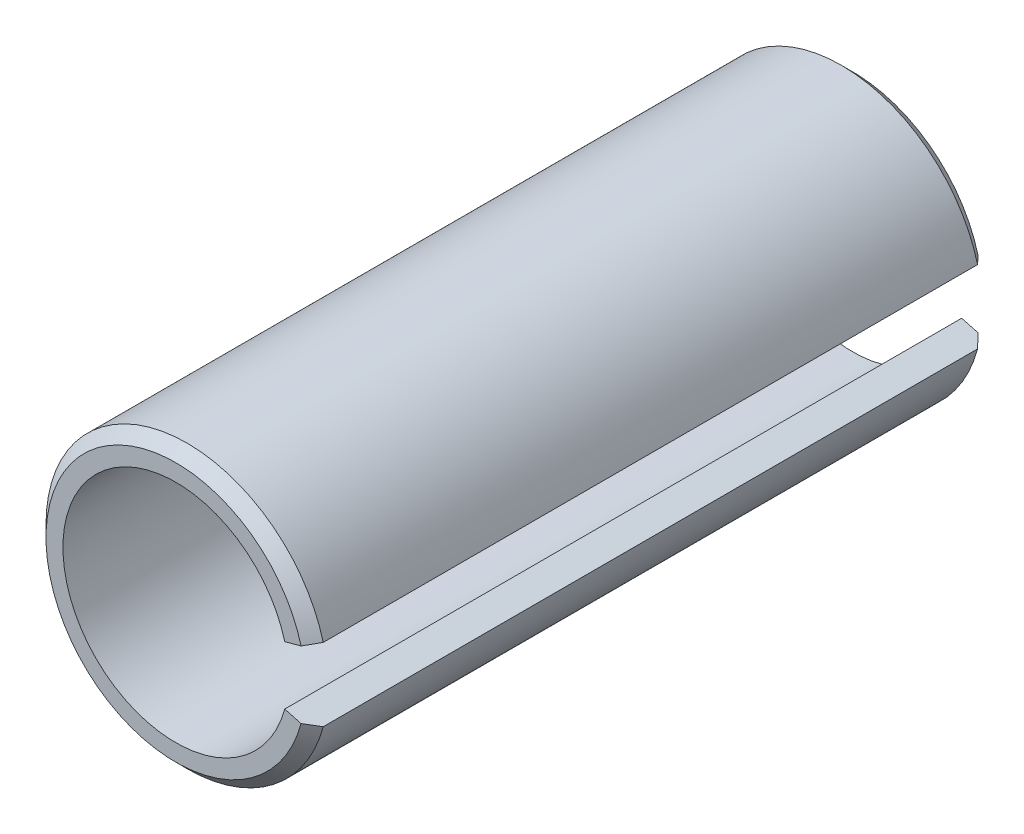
from build123d import *

# Parameters (mm, degrees)
EXTRUDE1_DEPTH = 6
CHAMFER1_SIZE  = 0.1


with BuildPart() as part:
    # Sketch1 → Extrude1 (new body)
    with BuildSketch(Plane.XY):
        with BuildLine():
            Line((0.965925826, 0.258819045), (1.207407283, 0.323523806))
            ThreePointArc((1.207407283, 0.323523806), (-1.25, 0), (1.207407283, -0.323523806))
            Line((1.207407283, -0.323523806), (0.965925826, -0.258819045))
            ThreePointArc((0.965925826, -0.258819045), (-1, 0), (0.965925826, 0.258819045))
        make_face()
    extrude(amount=-EXTRUDE1_DEPTH)

    # Chamfer1
    chamfer1_edges = [part.edges().sort_by_distance(p)[0] for p in [
        (-1.25, 0, -6),
        (-1.25, 0, 0),
    ]]
    chamfer(chamfer1_edges, length=CHAMFER1_SIZE)


solid = part.part
